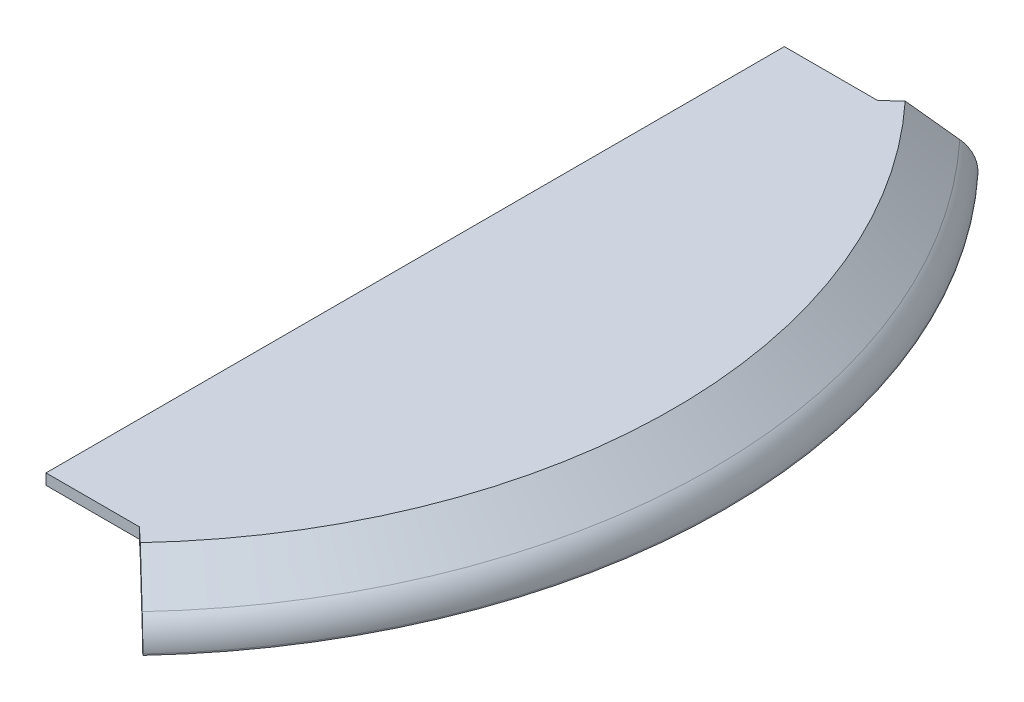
from build123d import *

# Parameters (mm, degrees)
ESQUISSE2_OUTSIDE_W     = 438.226
ESQUISSE2_OUTSIDE_H     = 438.226
ENL_V_MAT_EXTRU_1_DEPTH = 329.54956367


with BuildPart() as part:
    # Esquisse1 → R_volution1 (revolve)
    with BuildSketch(Plane.XY, mode=Mode.PRIVATE) as r_volution1_sk:
        with BuildLine():
            Line((-170, 0), (-168, 0))
            Line((-168, 0), (-168, 3.5))
            Line((-168, 3.5), (-167.120458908, 3.5))
            Line((-167.120458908, 3.5), (-154.607046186, 14))
            Line((-154.607046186, 14), (0, 14))
            Line((0, 14), (0, 17))
            Line((0, 17), (-155.698956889, 17))
            Line((-155.698956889, 17), (-166.427876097, 7.99736785))
            ThreePointArc((-166.427876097, 7.99736785), (-169.06307787, 4.563106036), (-170, 0.336923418))
            Line((-170, 0.336923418), (-170, 0))
        make_face()
    revolve(r_volution1_sk.sketch.rotate(Axis((0, -23.411866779, 0), (0, 1, 0)), 270), axis=Axis((0, -23.411866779, 0), (0, 1, 0)))

    # Esquisse2 outside → Enl_v. mat.-Extru.1 (cut, through all)
    with BuildSketch(Plane(origin=(-94.876179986, 17, -23.639936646), x_dir=(-1, 0, 0), z_dir=(0, 1, 0))):
        with Locations((-94.876, 23.64)):
            Rectangle(ESQUISSE2_OUTSIDE_W, ESQUISSE2_OUTSIDE_H)
        with BuildLine():
            Line((-178.876179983, 126.139936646), (-178.876179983, -78.860063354))
            Line((-178.876179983, -78.860063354), (-204.793972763, -78.860063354))
            Line((-204.793972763, -78.860063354), (-219.206309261, -92.299784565))
            ThreePointArc((-219.206309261, -92.299784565), (-264.876179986, 23.639936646), (-219.206309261, 139.579657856))
            Line((-219.206309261, 139.579657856), (-204.793972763, 126.139936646))
            Line((-204.793972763, 126.139936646), (-178.876179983, 126.139936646))
        make_face(mode=Mode.SUBTRACT)
    extrude(amount=-ENL_V_MAT_EXTRU_1_DEPTH, mode=Mode.SUBTRACT)


solid = part.part
